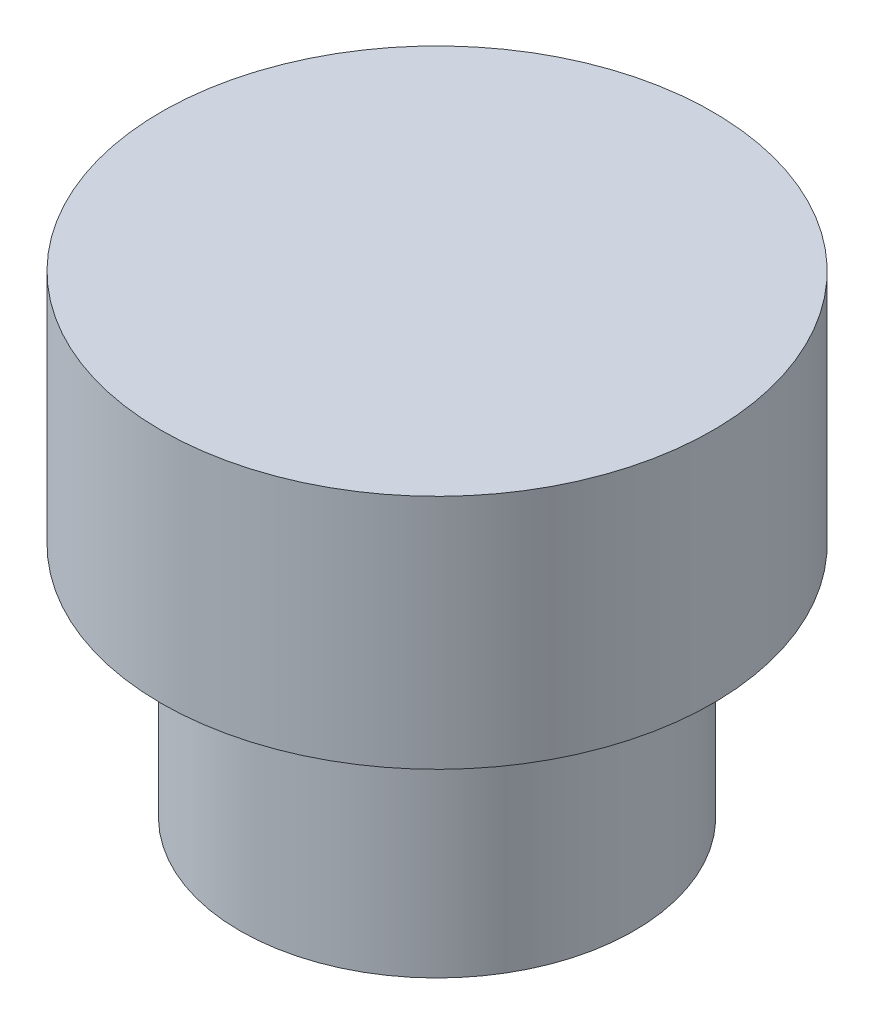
from build123d import *

# Parameters (mm, degrees)
ESQUISSE1_R          = 1.75
BASE_EXTRUSION_DEPTH = 1.5
ESQUISSE2_R          = 1.25
BOSS_EXTRU_1_DEPTH   = 1.5


with BuildPart() as part:
    # Esquisse1 → Base-Extrusion (new body)
    with BuildSketch(Plane(origin=(0, 0, 0), x_dir=(1, 0, 0), z_dir=(0, 1, 0))):
        with Locations(Location((0, 0, 0), (0, 0, 270))):
            Circle(ESQUISSE1_R)
    extrude(amount=BASE_EXTRUSION_DEPTH)

    # Esquisse2 → Boss.-Extru.1 (add)
    with BuildSketch(Plane.XZ):
        with Locations(Location((0, 0, 0), (0, 0, 90))):
            Circle(ESQUISSE2_R)
    extrude(amount=BOSS_EXTRU_1_DEPTH)


solid = part.part
